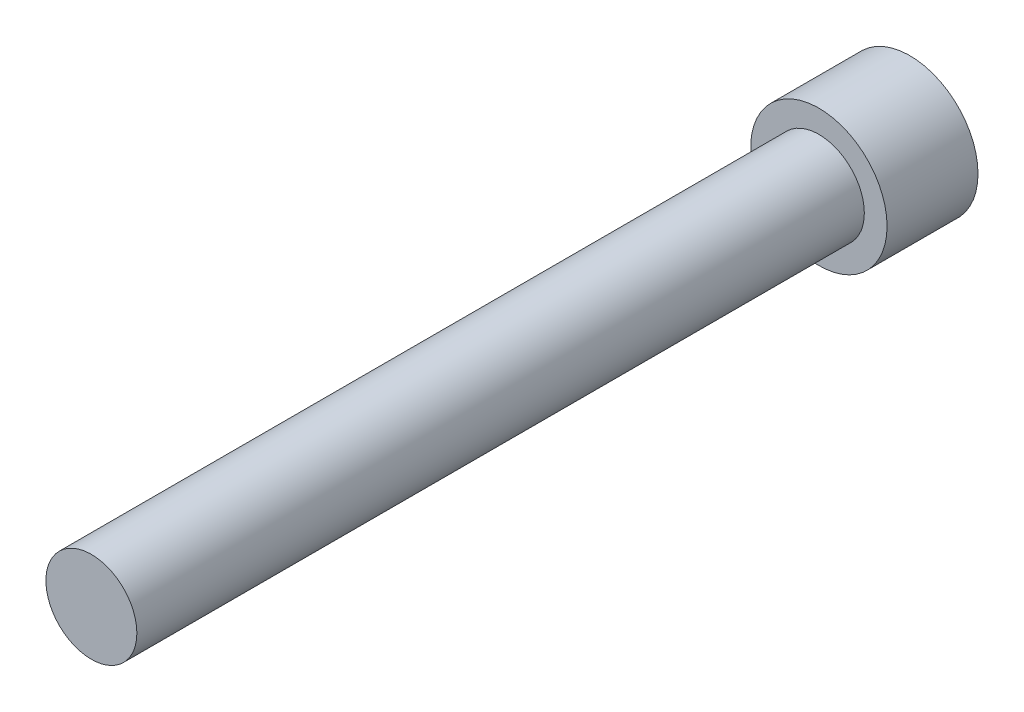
from build123d import *

# Parameters (mm, degrees)
HEX_2_DEPTH = 3.556


with BuildPart() as part:
    # Sketch6 → Revolve1 (revolve)
    with BuildSketch(Plane(origin=(0, 0, 0), x_dir=(0, 0, -1), z_dir=(1, 0, 0)), mode=Mode.PRIVATE) as revolve1_sk:
        Polygon((-50.8, 0), (-50.8, -3.175), (0, -3.175), (0, -4.7625), (6.35, -4.7625), (6.35, 0), align=None)
    revolve(revolve1_sk.sketch.rotate(Axis((0, 0, 50.8), (0, 0, -1)), 270), axis=Axis((0, 0, 50.8), (0, 0, -1)))

    # Sketch7 → HEX 2 (cut)
    with BuildSketch(Plane(origin=(0, 0, -6.35), x_dir=(-1, 0, 0), z_dir=(0, 0, -1))):
        Polygon((-2.3876, 1.378481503), (-2.3876, -1.378481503), (0, -2.756963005), (2.3876, -1.378481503), (2.3876, 1.378481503), (0, 2.756963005), align=None)
    extrude(amount=-HEX_2_DEPTH, mode=Mode.SUBTRACT)


solid = part.part
